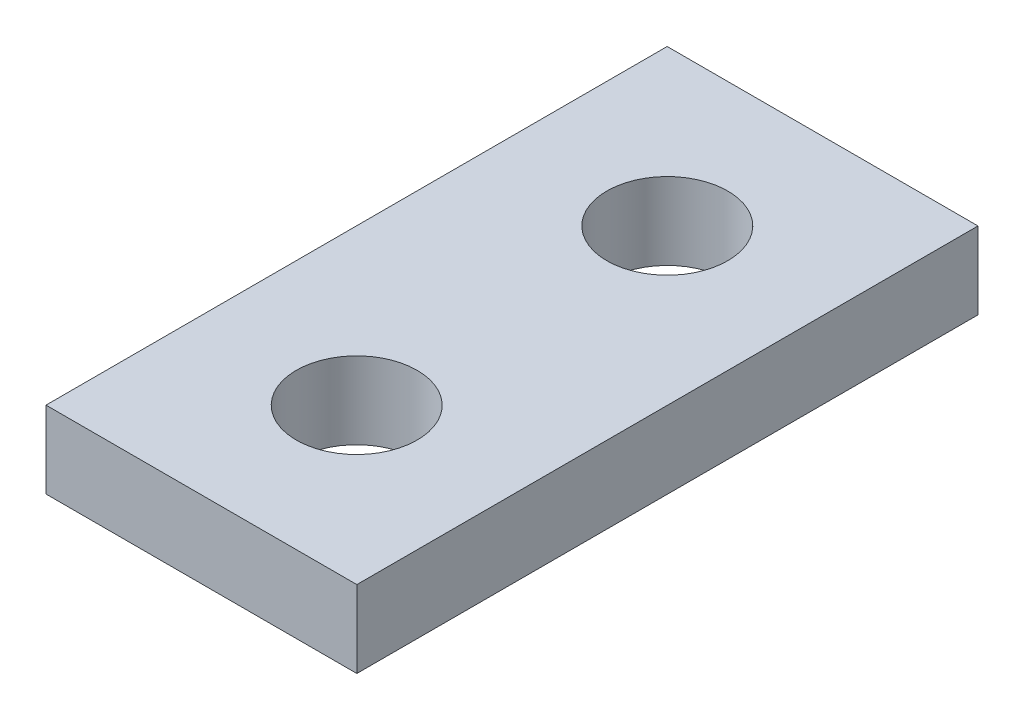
ISO-10303-21;
HEADER;
FILE_DESCRIPTION(('STEP AP214'),'2;1');
FILE_NAME('part.step','',(''),(''),'','','');
FILE_SCHEMA(('AUTOMOTIVE_DESIGN { 1 0 10303 214 1 1 1 1 }'));
ENDSEC;
DATA;
#1=APPLICATION_CONTEXT('core data for automotive mechanical design processes');
#2=APPLICATION_PROTOCOL_DEFINITION('international standard','automotive_design',2000,#1);
#3=PRODUCT_CONTEXT('',#1,'mechanical');
#4=PRODUCT('Part','Part','',(#3));
#5=PRODUCT_RELATED_PRODUCT_CATEGORY('part','',(#4));
#6=PRODUCT_DEFINITION_FORMATION('','',#4);
#7=PRODUCT_DEFINITION_CONTEXT('part definition',#1,'design');
#8=PRODUCT_DEFINITION('design','',#6,#7);
#9=PRODUCT_DEFINITION_SHAPE('','',#8);
#10=(LENGTH_UNIT() NAMED_UNIT(*) SI_UNIT(.MILLI.,.METRE.));
#11=(NAMED_UNIT(*) PLANE_ANGLE_UNIT() SI_UNIT($,.RADIAN.));
#12=(NAMED_UNIT(*) SI_UNIT($,.STERADIAN.) SOLID_ANGLE_UNIT());
#13=UNCERTAINTY_MEASURE_WITH_UNIT(LENGTH_MEASURE(1.E-05),#10,'distance_accuracy_value','');
#14=(GEOMETRIC_REPRESENTATION_CONTEXT(3) GLOBAL_UNCERTAINTY_ASSIGNED_CONTEXT((#13)) GLOBAL_UNIT_ASSIGNED_CONTEXT((#10,
#11,#12)) REPRESENTATION_CONTEXT('',''));
#15=CARTESIAN_POINT('',(0.,0.,0.));
#16=DIRECTION('',(0.,0.,1.));
#17=DIRECTION('',(1.,0.,0.));
#18=AXIS2_PLACEMENT_3D('',#15,#16,#17);
#19=CARTESIAN_POINT('',(4.76631,2.3622,9.525));
#20=DIRECTION('',(-1.,0.,0.));
#21=DIRECTION('',(0.,0.,1.));
#22=AXIS2_PLACEMENT_3D('',#19,#20,#21);
#23=PLANE('',#22);
#24=DIRECTION('',(0.,0.,-1.));
#25=VECTOR('',#24,1.);
#26=CARTESIAN_POINT('',(4.76631,0.,9.525));
#27=LINE('',#26,#25);
#28=CARTESIAN_POINT('',(4.76631,0.,9.525));
#29=VERTEX_POINT('',#28);
#30=CARTESIAN_POINT('',(4.76631,0.,-9.525));
#31=VERTEX_POINT('',#30);
#32=EDGE_CURVE('E98',#29,#31,#27,.T.);
#33=ORIENTED_EDGE('',*,*,#32,.T.);
#34=DIRECTION('',(0.,-1.,0.));
#35=VECTOR('',#34,1.);
#36=CARTESIAN_POINT('',(4.76631,2.3622,-9.525));
#37=LINE('',#36,#35);
#38=CARTESIAN_POINT('',(4.76631,2.3622,-9.525));
#39=VERTEX_POINT('',#38);
#40=EDGE_CURVE('E11',#39,#31,#37,.T.);
#41=ORIENTED_EDGE('',*,*,#40,.F.);
#42=DIRECTION('',(0.,0.,-1.));
#43=VECTOR('',#42,1.);
#44=CARTESIAN_POINT('',(4.76631,2.3622,9.525));
#45=LINE('',#44,#43);
#46=CARTESIAN_POINT('',(4.76631,2.3622,9.525));
#47=VERTEX_POINT('',#46);
#48=EDGE_CURVE('E86',#47,#39,#45,.T.);
#49=ORIENTED_EDGE('',*,*,#48,.F.);
#50=DIRECTION('',(0.,-1.,0.));
#51=VECTOR('',#50,1.);
#52=CARTESIAN_POINT('',(4.76631,2.3622,9.525));
#53=LINE('',#52,#51);
#54=EDGE_CURVE('E94',#47,#29,#53,.T.);
#55=ORIENTED_EDGE('',*,*,#54,.T.);
#56=EDGE_LOOP('',(#33,#41,#49,#55));
#57=FACE_BOUND('',#56,.T.);
#58=ADVANCED_FACE('F35',(#57),#23,.F.);
#59=CARTESIAN_POINT('',(-4.76631,2.3622,-9.525));
#60=DIRECTION('',(0.,0.,1.));
#61=DIRECTION('',(1.,0.,0.));
#62=AXIS2_PLACEMENT_3D('',#59,#60,#61);
#63=PLANE('',#62);
#64=DIRECTION('',(-1.,0.,0.));
#65=VECTOR('',#64,1.);
#66=CARTESIAN_POINT('',(-4.76631,0.,-9.525));
#67=LINE('',#66,#65);
#68=CARTESIAN_POINT('',(-4.76631,0.,-9.525));
#69=VERTEX_POINT('',#68);
#70=EDGE_CURVE('E90',#31,#69,#67,.T.);
#71=ORIENTED_EDGE('',*,*,#70,.T.);
#72=DIRECTION('',(0.,-1.,0.));
#73=VECTOR('',#72,1.);
#74=CARTESIAN_POINT('',(-4.76631,2.3622,-9.525));
#75=LINE('',#74,#73);
#76=CARTESIAN_POINT('',(-4.76631,2.3622,-9.525));
#77=VERTEX_POINT('',#76);
#78=EDGE_CURVE('E43',#77,#69,#75,.T.);
#79=ORIENTED_EDGE('',*,*,#78,.F.);
#80=DIRECTION('',(-1.,0.,0.));
#81=VECTOR('',#80,1.);
#82=CARTESIAN_POINT('',(-4.76631,2.3622,-9.525));
#83=LINE('',#82,#81);
#84=EDGE_CURVE('E81',#39,#77,#83,.T.);
#85=ORIENTED_EDGE('',*,*,#84,.F.);
#86=ORIENTED_EDGE('',*,*,#40,.T.);
#87=EDGE_LOOP('',(#71,#79,#85,#86));
#88=FACE_BOUND('',#87,.T.);
#89=ADVANCED_FACE('F89',(#88),#63,.F.);
#90=CARTESIAN_POINT('',(-4.76631,2.3622,9.525));
#91=DIRECTION('',(1.,0.,0.));
#92=DIRECTION('',(0.,0.,-1.));
#93=AXIS2_PLACEMENT_3D('',#90,#91,#92);
#94=PLANE('',#93);
#95=DIRECTION('',(0.,0.,1.));
#96=VECTOR('',#95,1.);
#97=CARTESIAN_POINT('',(-4.76631,0.,9.525));
#98=LINE('',#97,#96);
#99=CARTESIAN_POINT('',(-4.76631,0.,9.525));
#100=VERTEX_POINT('',#99);
#101=EDGE_CURVE('E68',#69,#100,#98,.T.);
#102=ORIENTED_EDGE('',*,*,#101,.T.);
#103=DIRECTION('',(0.,-1.,0.));
#104=VECTOR('',#103,1.);
#105=CARTESIAN_POINT('',(-4.76631,2.3622,9.525));
#106=LINE('',#105,#104);
#107=CARTESIAN_POINT('',(-4.76631,2.3622,9.525));
#108=VERTEX_POINT('',#107);
#109=EDGE_CURVE('E91',#108,#100,#106,.T.);
#110=ORIENTED_EDGE('',*,*,#109,.F.);
#111=DIRECTION('',(0.,0.,1.));
#112=VECTOR('',#111,1.);
#113=CARTESIAN_POINT('',(-4.76631,2.3622,9.525));
#114=LINE('',#113,#112);
#115=EDGE_CURVE('E84',#77,#108,#114,.T.);
#116=ORIENTED_EDGE('',*,*,#115,.F.);
#117=ORIENTED_EDGE('',*,*,#78,.T.);
#118=EDGE_LOOP('',(#102,#110,#116,#117));
#119=FACE_BOUND('',#118,.T.);
#120=ADVANCED_FACE('F92',(#119),#94,.F.);
#121=CARTESIAN_POINT('',(-4.76631,2.3622,9.525));
#122=DIRECTION('',(0.,0.,-1.));
#123=DIRECTION('',(-1.,0.,0.));
#124=AXIS2_PLACEMENT_3D('',#121,#122,#123);
#125=PLANE('',#124);
#126=DIRECTION('',(1.,0.,0.));
#127=VECTOR('',#126,1.);
#128=CARTESIAN_POINT('',(-4.76631,0.,9.525));
#129=LINE('',#128,#127);
#130=EDGE_CURVE('E74',#100,#29,#129,.T.);
#131=ORIENTED_EDGE('',*,*,#130,.T.);
#132=ORIENTED_EDGE('',*,*,#54,.F.);
#133=DIRECTION('',(1.,0.,0.));
#134=VECTOR('',#133,1.);
#135=CARTESIAN_POINT('',(-4.76631,2.3622,9.525));
#136=LINE('',#135,#134);
#137=EDGE_CURVE('E51',#108,#47,#136,.T.);
#138=ORIENTED_EDGE('',*,*,#137,.F.);
#139=ORIENTED_EDGE('',*,*,#109,.T.);
#140=EDGE_LOOP('',(#131,#132,#138,#139));
#141=FACE_BOUND('',#140,.T.);
#142=ADVANCED_FACE('F106',(#141),#125,.F.);
#143=CARTESIAN_POINT('',(0.,2.3622,0.));
#144=DIRECTION('',(0.,-1.,0.));
#145=DIRECTION('',(0.,0.,-1.));
#146=AXIS2_PLACEMENT_3D('',#143,#144,#145);
#147=PLANE('',#146);
#148=CARTESIAN_POINT('',(0.,2.3622,4.7625));
#149=DIRECTION('',(0.,1.,0.));
#150=DIRECTION('',(0.,0.,-1.));
#151=AXIS2_PLACEMENT_3D('',#148,#149,#150);
#152=CIRCLE('',#151,1.8542);
#153=CARTESIAN_POINT('',(0.,2.3622,2.9083));
#154=VERTEX_POINT('',#153);
#155=EDGE_CURVE('E118',#154,#154,#152,.T.);
#156=ORIENTED_EDGE('',*,*,#155,.F.);
#157=EDGE_LOOP('',(#156));
#158=FACE_BOUND('',#157,.T.);
#159=CARTESIAN_POINT('',(0.,2.3622,-4.7625));
#160=DIRECTION('',(0.,1.,0.));
#161=DIRECTION('',(0.,0.,1.));
#162=AXIS2_PLACEMENT_3D('',#159,#160,#161);
#163=CIRCLE('',#162,1.8542);
#164=CARTESIAN_POINT('',(0.,2.3622,-2.9083));
#165=VERTEX_POINT('',#164);
#166=EDGE_CURVE('E112',#165,#165,#163,.T.);
#167=ORIENTED_EDGE('',*,*,#166,.F.);
#168=EDGE_LOOP('',(#167));
#169=FACE_BOUND('',#168,.T.);
#170=ORIENTED_EDGE('',*,*,#48,.T.);
#171=ORIENTED_EDGE('',*,*,#84,.T.);
#172=ORIENTED_EDGE('',*,*,#115,.T.);
#173=ORIENTED_EDGE('',*,*,#137,.T.);
#174=EDGE_LOOP('',(#170,#171,#172,#173));
#175=FACE_BOUND('',#174,.T.);
#176=ADVANCED_FACE('F82',(#158,#169,#175),#147,.F.);
#177=CARTESIAN_POINT('',(0.,0.,0.));
#178=DIRECTION('',(0.,-1.,0.));
#179=DIRECTION('',(0.,0.,-1.));
#180=AXIS2_PLACEMENT_3D('',#177,#178,#179);
#181=PLANE('',#180);
#182=CARTESIAN_POINT('',(0.,0.,4.7625));
#183=DIRECTION('',(0.,1.,0.));
#184=DIRECTION('',(0.,0.,-1.));
#185=AXIS2_PLACEMENT_3D('',#182,#183,#184);
#186=CIRCLE('',#185,1.8542);
#187=CARTESIAN_POINT('',(0.,0.,2.9083));
#188=VERTEX_POINT('',#187);
#189=EDGE_CURVE('E115',#188,#188,#186,.T.);
#190=ORIENTED_EDGE('',*,*,#189,.T.);
#191=EDGE_LOOP('',(#190));
#192=FACE_BOUND('',#191,.T.);
#193=CARTESIAN_POINT('',(0.,0.,-4.7625));
#194=DIRECTION('',(0.,1.,0.));
#195=DIRECTION('',(0.,0.,1.));
#196=AXIS2_PLACEMENT_3D('',#193,#194,#195);
#197=CIRCLE('',#196,1.8542);
#198=CARTESIAN_POINT('',(0.,0.,-2.9083));
#199=VERTEX_POINT('',#198);
#200=EDGE_CURVE('E101',#199,#199,#197,.T.);
#201=ORIENTED_EDGE('',*,*,#200,.T.);
#202=EDGE_LOOP('',(#201));
#203=FACE_BOUND('',#202,.T.);
#204=ORIENTED_EDGE('',*,*,#32,.F.);
#205=ORIENTED_EDGE('',*,*,#130,.F.);
#206=ORIENTED_EDGE('',*,*,#101,.F.);
#207=ORIENTED_EDGE('',*,*,#70,.F.);
#208=EDGE_LOOP('',(#204,#205,#206,#207));
#209=FACE_BOUND('',#208,.T.);
#210=ADVANCED_FACE('F109',(#192,#203,#209),#181,.T.);
#211=CARTESIAN_POINT('',(0.,0.,-4.7625));
#212=DIRECTION('',(0.,1.,0.));
#213=DIRECTION('',(0.,0.,1.));
#214=AXIS2_PLACEMENT_3D('',#211,#212,#213);
#215=CYLINDRICAL_SURFACE('',#214,1.8542);
#216=ORIENTED_EDGE('',*,*,#200,.F.);
#217=EDGE_LOOP('',(#216));
#218=FACE_BOUND('',#217,.T.);
#219=ORIENTED_EDGE('',*,*,#166,.T.);
#220=EDGE_LOOP('',(#219));
#221=FACE_BOUND('',#220,.T.);
#222=ADVANCED_FACE('F129',(#218,#221),#215,.F.);
#223=CARTESIAN_POINT('',(0.,0.,4.7625));
#224=DIRECTION('',(0.,1.,0.));
#225=DIRECTION('',(0.,0.,1.));
#226=AXIS2_PLACEMENT_3D('',#223,#224,#225);
#227=CYLINDRICAL_SURFACE('',#226,1.8542);
#228=ORIENTED_EDGE('',*,*,#189,.F.);
#229=EDGE_LOOP('',(#228));
#230=FACE_BOUND('',#229,.T.);
#231=ORIENTED_EDGE('',*,*,#155,.T.);
#232=EDGE_LOOP('',(#231));
#233=FACE_BOUND('',#232,.T.);
#234=ADVANCED_FACE('F126',(#230,#233),#227,.F.);
#235=CLOSED_SHELL('',(#58,#89,#120,#142,#176,#210,#222,#234));
#236=MANIFOLD_SOLID_BREP('B2',#235);
#237=ADVANCED_BREP_SHAPE_REPRESENTATION('',(#18,#236),#14);
#238=SHAPE_DEFINITION_REPRESENTATION(#9,#237);
ENDSEC;
END-ISO-10303-21;
